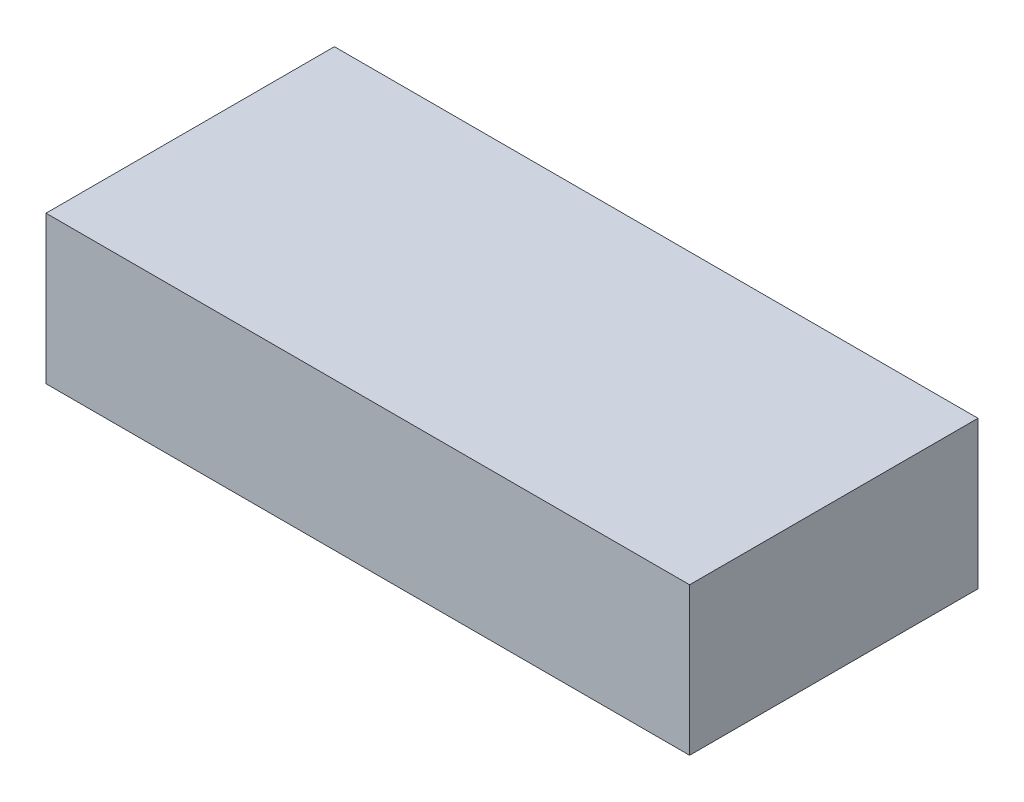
from build123d import *

# Parameters (mm, degrees)
SKETCH1_W           = 91.5
SKETCH1_H           = 41
BOSS_EXTRUDE1_DEPTH = 21


with BuildPart() as part:
    # Sketch1 → Boss-Extrude1 (new body)
    with BuildSketch(Plane(origin=(0, 0, 0), x_dir=(1, 0, 0), z_dir=(0, 1, 0))):
        with Locations((45.75, 20.5)):
            Rectangle(SKETCH1_W, SKETCH1_H)
    extrude(amount=BOSS_EXTRUDE1_DEPTH)


solid = part.part
